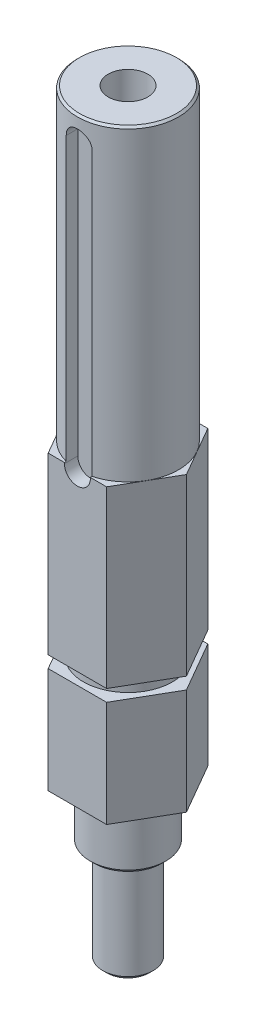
ISO-10303-21;
HEADER;
FILE_DESCRIPTION(('STEP AP214'),'2;1');
FILE_NAME('part.step','',(''),(''),'','','');
FILE_SCHEMA(('AUTOMOTIVE_DESIGN { 1 0 10303 214 1 1 1 1 }'));
ENDSEC;
DATA;
#1=APPLICATION_CONTEXT('core data for automotive mechanical design processes');
#2=APPLICATION_PROTOCOL_DEFINITION('international standard','automotive_design',2000,#1);
#3=PRODUCT_CONTEXT('',#1,'mechanical');
#4=PRODUCT('Part','Part','',(#3));
#5=PRODUCT_RELATED_PRODUCT_CATEGORY('part','',(#4));
#6=PRODUCT_DEFINITION_FORMATION('','',#4);
#7=PRODUCT_DEFINITION_CONTEXT('part definition',#1,'design');
#8=PRODUCT_DEFINITION('design','',#6,#7);
#9=PRODUCT_DEFINITION_SHAPE('','',#8);
#10=(LENGTH_UNIT() NAMED_UNIT(*) SI_UNIT(.MILLI.,.METRE.));
#11=(NAMED_UNIT(*) PLANE_ANGLE_UNIT() SI_UNIT($,.RADIAN.));
#12=(NAMED_UNIT(*) SI_UNIT($,.STERADIAN.) SOLID_ANGLE_UNIT());
#13=UNCERTAINTY_MEASURE_WITH_UNIT(LENGTH_MEASURE(1.E-05),#10,'distance_accuracy_value','');
#14=(GEOMETRIC_REPRESENTATION_CONTEXT(3) GLOBAL_UNCERTAINTY_ASSIGNED_CONTEXT((#13)) GLOBAL_UNIT_ASSIGNED_CONTEXT((#10,
#11,#12)) REPRESENTATION_CONTEXT('',''));
#15=CARTESIAN_POINT('',(0.,0.,0.));
#16=DIRECTION('',(0.,0.,1.));
#17=DIRECTION('',(1.,0.,0.));
#18=AXIS2_PLACEMENT_3D('',#15,#16,#17);
#19=CARTESIAN_POINT('',(-38.3071337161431,-56.515,-16.669011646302));
#20=DIRECTION('',(0.,1.,0.));
#21=DIRECTION('',(0.,0.,1.));
#22=AXIS2_PLACEMENT_3D('',#19,#20,#21);
#23=PLANE('',#22);
#24=CARTESIAN_POINT('',(-38.3071337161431,-56.515000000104,-16.669011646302));
#25=DIRECTION('',(0.,1.,0.));
#26=DIRECTION('',(0.,0.,1.));
#27=AXIS2_PLACEMENT_3D('',#24,#25,#26);
#28=CIRCLE('',#27,2.6542999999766);
#29=CARTESIAN_POINT('',(-38.3071337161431,-56.515000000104,-14.0147116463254));
#30=VERTEX_POINT('',#29);
#31=EDGE_CURVE('E19',#30,#30,#28,.T.);
#32=ORIENTED_EDGE('',*,*,#31,.F.);
#33=EDGE_LOOP('',(#32));
#34=FACE_BOUND('',#33,.T.);
#35=ADVANCED_FACE('F16',(#34),#23,.F.);
#36=CARTESIAN_POINT('',(-38.3071337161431,-56.007000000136,-16.669011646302));
#37=DIRECTION('',(0.,1.,0.));
#38=DIRECTION('',(0.,0.,1.));
#39=AXIS2_PLACEMENT_3D('',#36,#37,#38);
#40=CONICAL_SURFACE('',#39,3.16229999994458,0.785398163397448);
#41=CARTESIAN_POINT('',(-38.3071337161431,-56.007,-16.669011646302));
#42=DIRECTION('',(0.,-1.,0.));
#43=DIRECTION('',(0.,0.,-1.));
#44=AXIS2_PLACEMENT_3D('',#41,#42,#43);
#45=CIRCLE('',#44,3.1623);
#46=CARTESIAN_POINT('',(-38.3071337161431,-56.007,-19.831311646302));
#47=VERTEX_POINT('',#46);
#48=EDGE_CURVE('E145',#47,#47,#45,.F.);
#49=ORIENTED_EDGE('',*,*,#48,.F.);
#50=EDGE_LOOP('',(#49));
#51=FACE_BOUND('',#50,.T.);
#52=ORIENTED_EDGE('',*,*,#31,.T.);
#53=EDGE_LOOP('',(#52));
#54=FACE_BOUND('',#53,.T.);
#55=ADVANCED_FACE('F399',(#51,#54),#40,.T.);
#56=CARTESIAN_POINT('',(-38.3071337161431,-56.515,-16.669011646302));
#57=DIRECTION('',(0.,-1.,0.));
#58=DIRECTION('',(0.,0.,-1.));
#59=AXIS2_PLACEMENT_3D('',#56,#57,#58);
#60=CYLINDRICAL_SURFACE('',#59,3.1623);
#61=CARTESIAN_POINT('',(-38.3071337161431,-43.815,-16.669011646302));
#62=DIRECTION('',(0.,-1.,0.));
#63=DIRECTION('',(0.,0.,-1.));
#64=AXIS2_PLACEMENT_3D('',#61,#62,#63);
#65=CIRCLE('',#64,3.1623);
#66=CARTESIAN_POINT('',(-38.3071337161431,-43.815,-19.831311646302));
#67=VERTEX_POINT('',#66);
#68=EDGE_CURVE('E148',#67,#67,#65,.T.);
#69=ORIENTED_EDGE('',*,*,#68,.T.);
#70=EDGE_LOOP('',(#69));
#71=FACE_BOUND('',#70,.T.);
#72=ORIENTED_EDGE('',*,*,#48,.T.);
#73=EDGE_LOOP('',(#72));
#74=FACE_BOUND('',#73,.T.);
#75=ADVANCED_FACE('F384',(#71,#74),#60,.T.);
#76=CARTESIAN_POINT('',(-38.3071337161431,-43.815,-16.669011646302));
#77=DIRECTION('',(0.,1.,0.));
#78=DIRECTION('',(0.,0.,1.));
#79=AXIS2_PLACEMENT_3D('',#76,#77,#78);
#80=PLANE('',#79);
#81=CARTESIAN_POINT('',(-38.3071337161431,-43.8149999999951,-16.669011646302));
#82=DIRECTION('',(0.,1.,0.));
#83=DIRECTION('',(0.,0.,1.));
#84=AXIS2_PLACEMENT_3D('',#81,#82,#83);
#85=CIRCLE('',#84,4.24180000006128);
#86=CARTESIAN_POINT('',(-38.3071337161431,-43.8149999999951,-12.4272116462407));
#87=VERTEX_POINT('',#86);
#88=EDGE_CURVE('E142',#87,#87,#85,.T.);
#89=ORIENTED_EDGE('',*,*,#88,.F.);
#90=EDGE_LOOP('',(#89));
#91=FACE_BOUND('',#90,.T.);
#92=ORIENTED_EDGE('',*,*,#68,.F.);
#93=EDGE_LOOP('',(#92));
#94=FACE_BOUND('',#93,.T.);
#95=ADVANCED_FACE('F387',(#91,#94),#80,.F.);
#96=CARTESIAN_POINT('',(-38.3071337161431,-43.3070000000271,-16.669011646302));
#97=DIRECTION('',(0.,1.,0.));
#98=DIRECTION('',(0.,0.,1.));
#99=AXIS2_PLACEMENT_3D('',#96,#97,#98);
#100=CONICAL_SURFACE('',#99,4.74980000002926,0.785398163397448);
#101=CARTESIAN_POINT('',(-38.3071337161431,-43.307,-16.669011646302));
#102=DIRECTION('',(0.,-1.,0.));
#103=DIRECTION('',(0.,0.,-1.));
#104=AXIS2_PLACEMENT_3D('',#101,#102,#103);
#105=CIRCLE('',#104,4.7498);
#106=CARTESIAN_POINT('',(-38.3071337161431,-43.307,-21.418811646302));
#107=VERTEX_POINT('',#106);
#108=EDGE_CURVE('E139',#107,#107,#105,.F.);
#109=ORIENTED_EDGE('',*,*,#108,.F.);
#110=EDGE_LOOP('',(#109));
#111=FACE_BOUND('',#110,.T.);
#112=ORIENTED_EDGE('',*,*,#88,.T.);
#113=EDGE_LOOP('',(#112));
#114=FACE_BOUND('',#113,.T.);
#115=ADVANCED_FACE('F389',(#111,#114),#100,.T.);
#116=CARTESIAN_POINT('',(-38.3071337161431,-43.815,-16.669011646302));
#117=DIRECTION('',(0.,-1.,0.));
#118=DIRECTION('',(0.,0.,-1.));
#119=AXIS2_PLACEMENT_3D('',#116,#117,#118);
#120=CYLINDRICAL_SURFACE('',#119,4.7498);
#121=CARTESIAN_POINT('',(-38.3071337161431,-36.703,-16.669011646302));
#122=DIRECTION('',(0.,-1.,0.));
#123=DIRECTION('',(0.,0.,-1.));
#124=AXIS2_PLACEMENT_3D('',#121,#122,#123);
#125=CIRCLE('',#124,4.7498);
#126=CARTESIAN_POINT('',(-38.3071337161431,-36.703,-21.418811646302));
#127=VERTEX_POINT('',#126);
#128=EDGE_CURVE('E121',#127,#127,#125,.T.);
#129=ORIENTED_EDGE('',*,*,#128,.T.);
#130=EDGE_LOOP('',(#129));
#131=FACE_BOUND('',#130,.T.);
#132=ORIENTED_EDGE('',*,*,#108,.T.);
#133=EDGE_LOOP('',(#132));
#134=FACE_BOUND('',#133,.T.);
#135=ADVANCED_FACE('F396',(#131,#134),#120,.T.);
#136=CARTESIAN_POINT('',(-38.3071337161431,-36.703,-3.96901164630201));
#137=DIRECTION('',(0.,1.,0.));
#138=DIRECTION('',(0.,0.,1.));
#139=AXIS2_PLACEMENT_3D('',#136,#137,#138);
#140=PLANE('',#139);
#141=DIRECTION('',(-0.5,0.,0.866025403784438));
#142=VECTOR('',#141,1.);
#143=CARTESIAN_POINT('',(-41.9733079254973,-36.703,-23.019011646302));
#144=LINE('',#143,#142);
#145=CARTESIAN_POINT('',(-41.9733079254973,-36.703,-23.019011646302));
#146=VERTEX_POINT('',#145);
#147=CARTESIAN_POINT('',(-45.6394821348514,-36.703,-16.669011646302));
#148=VERTEX_POINT('',#147);
#149=EDGE_CURVE('E110',#146,#148,#144,.T.);
#150=ORIENTED_EDGE('',*,*,#149,.F.);
#151=DIRECTION('',(-1.,0.,0.));
#152=VECTOR('',#151,1.);
#153=CARTESIAN_POINT('',(-34.640959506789,-36.703,-23.019011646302));
#154=LINE('',#153,#152);
#155=CARTESIAN_POINT('',(-34.640959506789,-36.703,-23.019011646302));
#156=VERTEX_POINT('',#155);
#157=EDGE_CURVE('E115',#156,#146,#154,.T.);
#158=ORIENTED_EDGE('',*,*,#157,.F.);
#159=DIRECTION('',(-0.5,0.,-0.866025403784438));
#160=VECTOR('',#159,1.);
#161=CARTESIAN_POINT('',(-30.9747852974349,-36.703,-16.669011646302));
#162=LINE('',#161,#160);
#163=CARTESIAN_POINT('',(-30.9747852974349,-36.703,-16.669011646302));
#164=VERTEX_POINT('',#163);
#165=EDGE_CURVE('E130',#164,#156,#162,.T.);
#166=ORIENTED_EDGE('',*,*,#165,.F.);
#167=DIRECTION('',(0.500000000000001,0.,-0.866025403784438));
#168=VECTOR('',#167,1.);
#169=CARTESIAN_POINT('',(-34.640959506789,-36.703,-10.319011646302));
#170=LINE('',#169,#168);
#171=CARTESIAN_POINT('',(-34.640959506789,-36.703,-10.319011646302));
#172=VERTEX_POINT('',#171);
#173=EDGE_CURVE('E347',#172,#164,#170,.T.);
#174=ORIENTED_EDGE('',*,*,#173,.F.);
#175=DIRECTION('',(1.,0.,0.));
#176=VECTOR('',#175,1.);
#177=CARTESIAN_POINT('',(-41.9733079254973,-36.703,-10.319011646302));
#178=LINE('',#177,#176);
#179=CARTESIAN_POINT('',(-41.9733079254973,-36.703,-10.319011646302));
#180=VERTEX_POINT('',#179);
#181=EDGE_CURVE('E341',#180,#172,#178,.T.);
#182=ORIENTED_EDGE('',*,*,#181,.F.);
#183=DIRECTION('',(0.5,0.,0.866025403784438));
#184=VECTOR('',#183,1.);
#185=CARTESIAN_POINT('',(-45.6394821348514,-36.703,-16.669011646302));
#186=LINE('',#185,#184);
#187=EDGE_CURVE('E118',#148,#180,#186,.T.);
#188=ORIENTED_EDGE('',*,*,#187,.F.);
#189=EDGE_LOOP('',(#150,#158,#166,#174,#182,#188));
#190=FACE_BOUND('',#189,.T.);
#191=ORIENTED_EDGE('',*,*,#128,.F.);
#192=EDGE_LOOP('',(#191));
#193=FACE_BOUND('',#192,.T.);
#194=ADVANCED_FACE('F112',(#190,#193),#140,.F.);
#195=CARTESIAN_POINT('',(-41.9733079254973,-36.703,-23.019011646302));
#196=DIRECTION('',(-0.866025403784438,0.,-0.5));
#197=DIRECTION('',(-0.5,0.,0.866025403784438));
#198=AXIS2_PLACEMENT_3D('',#195,#196,#197);
#199=PLANE('',#198);
#200=ORIENTED_EDGE('',*,*,#149,.T.);
#201=DIRECTION('',(0.,1.,0.));
#202=VECTOR('',#201,1.);
#203=CARTESIAN_POINT('',(-45.6394821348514,-36.703,-16.669011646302));
#204=LINE('',#203,#202);
#205=CARTESIAN_POINT('',(-45.6394821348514,-23.4188,-16.669011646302));
#206=VERTEX_POINT('',#205);
#207=EDGE_CURVE('E336',#206,#148,#204,.F.);
#208=ORIENTED_EDGE('',*,*,#207,.F.);
#209=DIRECTION('',(0.499999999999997,0.,-0.86602540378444));
#210=VECTOR('',#209,1.);
#211=CARTESIAN_POINT('',(-45.6394821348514,-23.4188,-16.669011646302));
#212=LINE('',#211,#210);
#213=CARTESIAN_POINT('',(-41.9733079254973,-23.4188,-23.019011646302));
#214=VERTEX_POINT('',#213);
#215=EDGE_CURVE('E127',#206,#214,#212,.T.);
#216=ORIENTED_EDGE('',*,*,#215,.T.);
#217=DIRECTION('',(0.,1.,0.));
#218=VECTOR('',#217,1.);
#219=CARTESIAN_POINT('',(-41.9733079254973,-36.703,-23.019011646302));
#220=LINE('',#219,#218);
#221=EDGE_CURVE('E124',#146,#214,#220,.T.);
#222=ORIENTED_EDGE('',*,*,#221,.F.);
#223=EDGE_LOOP('',(#200,#208,#216,#222));
#224=FACE_BOUND('',#223,.T.);
#225=ADVANCED_FACE('F125',(#224),#199,.T.);
#226=CARTESIAN_POINT('',(-34.640959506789,-36.703,-23.019011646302));
#227=DIRECTION('',(0.,0.,-1.));
#228=DIRECTION('',(-1.,0.,0.));
#229=AXIS2_PLACEMENT_3D('',#226,#227,#228);
#230=PLANE('',#229);
#231=ORIENTED_EDGE('',*,*,#157,.T.);
#232=ORIENTED_EDGE('',*,*,#221,.T.);
#233=DIRECTION('',(1.,0.,0.));
#234=VECTOR('',#233,1.);
#235=CARTESIAN_POINT('',(-21.7881364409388,-23.4188,-23.019011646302));
#236=LINE('',#235,#234);
#237=CARTESIAN_POINT('',(-34.640959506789,-23.4188,-23.019011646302));
#238=VERTEX_POINT('',#237);
#239=EDGE_CURVE('E329',#214,#238,#236,.T.);
#240=ORIENTED_EDGE('',*,*,#239,.T.);
#241=DIRECTION('',(0.,1.,0.));
#242=VECTOR('',#241,1.);
#243=CARTESIAN_POINT('',(-34.640959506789,-36.703,-23.019011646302));
#244=LINE('',#243,#242);
#245=EDGE_CURVE('E134',#156,#238,#244,.T.);
#246=ORIENTED_EDGE('',*,*,#245,.F.);
#247=EDGE_LOOP('',(#231,#232,#240,#246));
#248=FACE_BOUND('',#247,.T.);
#249=ADVANCED_FACE('F132',(#248),#230,.T.);
#250=CARTESIAN_POINT('',(-30.9747852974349,-36.703,-16.669011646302));
#251=DIRECTION('',(0.866025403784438,0.,-0.5));
#252=DIRECTION('',(-0.5,0.,-0.866025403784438));
#253=AXIS2_PLACEMENT_3D('',#250,#251,#252);
#254=PLANE('',#253);
#255=ORIENTED_EDGE('',*,*,#165,.T.);
#256=ORIENTED_EDGE('',*,*,#245,.T.);
#257=DIRECTION('',(0.499999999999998,0.,0.86602540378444));
#258=VECTOR('',#257,1.);
#259=CARTESIAN_POINT('',(-34.640959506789,-23.4188,-23.019011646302));
#260=LINE('',#259,#258);
#261=CARTESIAN_POINT('',(-30.9747852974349,-23.4188,-16.669011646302));
#262=VERTEX_POINT('',#261);
#263=EDGE_CURVE('E327',#238,#262,#260,.T.);
#264=ORIENTED_EDGE('',*,*,#263,.T.);
#265=DIRECTION('',(0.,1.,0.));
#266=VECTOR('',#265,1.);
#267=CARTESIAN_POINT('',(-30.9747852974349,-36.703,-16.669011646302));
#268=LINE('',#267,#266);
#269=EDGE_CURVE('E344',#164,#262,#268,.T.);
#270=ORIENTED_EDGE('',*,*,#269,.F.);
#271=EDGE_LOOP('',(#255,#256,#264,#270));
#272=FACE_BOUND('',#271,.T.);
#273=ADVANCED_FACE('F352',(#272),#254,.T.);
#274=CARTESIAN_POINT('',(-34.640959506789,-36.703,-10.319011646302));
#275=DIRECTION('',(0.866025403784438,0.,0.500000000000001));
#276=DIRECTION('',(0.500000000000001,0.,-0.866025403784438));
#277=AXIS2_PLACEMENT_3D('',#274,#275,#276);
#278=PLANE('',#277);
#279=ORIENTED_EDGE('',*,*,#173,.T.);
#280=ORIENTED_EDGE('',*,*,#269,.T.);
#281=DIRECTION('',(-0.499999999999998,0.,0.86602540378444));
#282=VECTOR('',#281,1.);
#283=CARTESIAN_POINT('',(-30.9747852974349,-23.4188,-16.669011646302));
#284=LINE('',#283,#282);
#285=CARTESIAN_POINT('',(-34.640959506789,-23.4188,-10.319011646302));
#286=VERTEX_POINT('',#285);
#287=EDGE_CURVE('E325',#262,#286,#284,.T.);
#288=ORIENTED_EDGE('',*,*,#287,.T.);
#289=DIRECTION('',(0.,1.,0.));
#290=VECTOR('',#289,1.);
#291=CARTESIAN_POINT('',(-34.640959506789,-36.703,-10.319011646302));
#292=LINE('',#291,#290);
#293=EDGE_CURVE('E338',#172,#286,#292,.T.);
#294=ORIENTED_EDGE('',*,*,#293,.F.);
#295=EDGE_LOOP('',(#279,#280,#288,#294));
#296=FACE_BOUND('',#295,.T.);
#297=ADVANCED_FACE('F357',(#296),#278,.T.);
#298=CARTESIAN_POINT('',(-41.9733079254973,-36.703,-10.319011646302));
#299=DIRECTION('',(0.,0.,1.));
#300=DIRECTION('',(1.,0.,0.));
#301=AXIS2_PLACEMENT_3D('',#298,#299,#300);
#302=PLANE('',#301);
#303=ORIENTED_EDGE('',*,*,#181,.T.);
#304=ORIENTED_EDGE('',*,*,#293,.T.);
#305=DIRECTION('',(1.,0.,0.));
#306=VECTOR('',#305,1.);
#307=CARTESIAN_POINT('',(-21.7881364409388,-23.4188,-10.319011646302));
#308=LINE('',#307,#306);
#309=CARTESIAN_POINT('',(-41.9733079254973,-23.4188,-10.319011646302));
#310=VERTEX_POINT('',#309);
#311=EDGE_CURVE('E323',#286,#310,#308,.F.);
#312=ORIENTED_EDGE('',*,*,#311,.T.);
#313=DIRECTION('',(0.,1.,0.));
#314=VECTOR('',#313,1.);
#315=CARTESIAN_POINT('',(-41.9733079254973,-36.703,-10.319011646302));
#316=LINE('',#315,#314);
#317=EDGE_CURVE('E332',#180,#310,#316,.T.);
#318=ORIENTED_EDGE('',*,*,#317,.F.);
#319=EDGE_LOOP('',(#303,#304,#312,#318));
#320=FACE_BOUND('',#319,.T.);
#321=ADVANCED_FACE('F361',(#320),#302,.T.);
#322=CARTESIAN_POINT('',(-45.6394821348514,-36.703,-16.669011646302));
#323=DIRECTION('',(-0.866025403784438,0.,0.5));
#324=DIRECTION('',(0.5,0.,0.866025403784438));
#325=AXIS2_PLACEMENT_3D('',#322,#323,#324);
#326=PLANE('',#325);
#327=ORIENTED_EDGE('',*,*,#187,.T.);
#328=ORIENTED_EDGE('',*,*,#317,.T.);
#329=DIRECTION('',(-0.499999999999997,0.,-0.86602540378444));
#330=VECTOR('',#329,1.);
#331=CARTESIAN_POINT('',(-41.9733079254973,-23.4188,-10.319011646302));
#332=LINE('',#331,#330);
#333=EDGE_CURVE('E320',#310,#206,#332,.T.);
#334=ORIENTED_EDGE('',*,*,#333,.T.);
#335=ORIENTED_EDGE('',*,*,#207,.T.);
#336=EDGE_LOOP('',(#327,#328,#334,#335));
#337=FACE_BOUND('',#336,.T.);
#338=ADVANCED_FACE('F364',(#337),#326,.T.);
#339=CARTESIAN_POINT('',(-21.7881364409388,-23.4188,-16.669011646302));
#340=DIRECTION('',(0.,-1.,0.));
#341=DIRECTION('',(0.,0.,-1.));
#342=AXIS2_PLACEMENT_3D('',#339,#340,#341);
#343=PLANE('',#342);
#344=ORIENTED_EDGE('',*,*,#311,.F.);
#345=ORIENTED_EDGE('',*,*,#287,.F.);
#346=ORIENTED_EDGE('',*,*,#263,.F.);
#347=ORIENTED_EDGE('',*,*,#239,.F.);
#348=ORIENTED_EDGE('',*,*,#215,.F.);
#349=ORIENTED_EDGE('',*,*,#333,.F.);
#350=EDGE_LOOP('',(#344,#345,#346,#347,#348,#349));
#351=FACE_BOUND('',#350,.T.);
#352=CARTESIAN_POINT('',(-38.3071337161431,-23.4188,-16.669011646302));
#353=DIRECTION('',(0.,-1.,0.));
#354=DIRECTION('',(0.,0.,-1.));
#355=AXIS2_PLACEMENT_3D('',#352,#353,#354);
#356=CIRCLE('',#355,5.58800000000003);
#357=CARTESIAN_POINT('',(-38.3071337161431,-23.4188,-22.257011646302));
#358=VERTEX_POINT('',#357);
#359=EDGE_CURVE('E317',#358,#358,#356,.F.);
#360=ORIENTED_EDGE('',*,*,#359,.F.);
#361=EDGE_LOOP('',(#360));
#362=FACE_BOUND('',#361,.T.);
#363=ADVANCED_FACE('F366',(#351,#362),#343,.F.);
#364=CARTESIAN_POINT('',(-38.3071337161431,22.7329999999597,-16.669011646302));
#365=DIRECTION('',(0.,1.,0.));
#366=DIRECTION('',(0.,0.,1.));
#367=AXIS2_PLACEMENT_3D('',#364,#365,#366);
#368=CONICAL_SURFACE('',#367,2.48792999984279,1.02974425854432);
#369=CARTESIAN_POINT('',(-38.3071337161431,21.2381008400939,-16.6690116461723));
#370=VERTEX_POINT('',#369);
#371=VERTEX_LOOP('',#370);
#372=FACE_BOUND('',#371,.T.);
#373=CARTESIAN_POINT('',(-38.3071337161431,22.733,-16.669011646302));
#374=DIRECTION('',(0.,1.,0.));
#375=DIRECTION('',(0.,0.,1.));
#376=AXIS2_PLACEMENT_3D('',#373,#374,#375);
#377=CIRCLE('',#376,2.48793);
#378=CARTESIAN_POINT('',(-38.3071337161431,22.733,-14.181081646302));
#379=VERTEX_POINT('',#378);
#380=EDGE_CURVE('E314',#379,#379,#377,.T.);
#381=ORIENTED_EDGE('',*,*,#380,.T.);
#382=EDGE_LOOP('',(#381));
#383=FACE_BOUND('',#382,.T.);
#384=ADVANCED_FACE('F369',(#372,#383),#368,.F.);
#385=CARTESIAN_POINT('',(-38.3071337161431,-25.4,-16.669011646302));
#386=DIRECTION('',(0.,-1.,0.));
#387=DIRECTION('',(0.,0.,-1.));
#388=AXIS2_PLACEMENT_3D('',#385,#386,#387);
#389=CYLINDRICAL_SURFACE('',#388,5.58800000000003);
#390=ORIENTED_EDGE('',*,*,#359,.T.);
#391=EDGE_LOOP('',(#390));
#392=FACE_BOUND('',#391,.T.);
#393=CARTESIAN_POINT('',(-38.3071337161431,-21.9202,-16.669011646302));
#394=DIRECTION('',(0.,-1.,0.));
#395=DIRECTION('',(0.,0.,-1.));
#396=AXIS2_PLACEMENT_3D('',#393,#394,#395);
#397=CIRCLE('',#396,5.58800000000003);
#398=CARTESIAN_POINT('',(-38.3071337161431,-21.9202,-22.257011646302));
#399=VERTEX_POINT('',#398);
#400=EDGE_CURVE('E265',#399,#399,#397,.T.);
#401=ORIENTED_EDGE('',*,*,#400,.T.);
#402=EDGE_LOOP('',(#401));
#403=FACE_BOUND('',#402,.T.);
#404=ADVANCED_FACE('F491',(#392,#403),#389,.T.);
#405=CARTESIAN_POINT('',(-38.3071337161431,38.608,-16.669011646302));
#406=DIRECTION('',(0.,1.,0.));
#407=DIRECTION('',(0.,0.,1.));
#408=AXIS2_PLACEMENT_3D('',#405,#406,#407);
#409=CYLINDRICAL_SURFACE('',#408,2.48793);
#410=CARTESIAN_POINT('',(-38.3071337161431,38.608,-16.669011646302));
#411=DIRECTION('',(0.,1.,0.));
#412=DIRECTION('',(0.,0.,1.));
#413=AXIS2_PLACEMENT_3D('',#410,#411,#412);
#414=CIRCLE('',#413,2.48793);
#415=CARTESIAN_POINT('',(-38.3071337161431,38.608,-14.181081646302));
#416=VERTEX_POINT('',#415);
#417=EDGE_CURVE('E267',#416,#416,#414,.T.);
#418=ORIENTED_EDGE('',*,*,#417,.T.);
#419=EDGE_LOOP('',(#418));
#420=FACE_BOUND('',#419,.T.);
#421=ORIENTED_EDGE('',*,*,#380,.F.);
#422=EDGE_LOOP('',(#421));
#423=FACE_BOUND('',#422,.T.);
#424=ADVANCED_FACE('F498',(#420,#423),#409,.F.);
#425=CARTESIAN_POINT('',(-32.7191337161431,-21.9202,-16.669011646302));
#426=DIRECTION('',(0.,1.,0.));
#427=DIRECTION('',(0.,0.,1.));
#428=AXIS2_PLACEMENT_3D('',#425,#426,#427);
#429=PLANE('',#428);
#430=ORIENTED_EDGE('',*,*,#400,.F.);
#431=EDGE_LOOP('',(#430));
#432=FACE_BOUND('',#431,.T.);
#433=DIRECTION('',(0.500000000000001,0.,-0.866025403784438));
#434=VECTOR('',#433,1.);
#435=CARTESIAN_POINT('',(-34.640959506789,-21.9202,-10.319011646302));
#436=LINE('',#435,#434);
#437=CARTESIAN_POINT('',(-34.640959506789,-21.9202,-10.319011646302));
#438=VERTEX_POINT('',#437);
#439=CARTESIAN_POINT('',(-30.9747852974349,-21.9202,-16.669011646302));
#440=VERTEX_POINT('',#439);
#441=EDGE_CURVE('E232',#438,#440,#436,.T.);
#442=ORIENTED_EDGE('',*,*,#441,.F.);
#443=DIRECTION('',(1.,0.,0.));
#444=VECTOR('',#443,1.);
#445=CARTESIAN_POINT('',(-41.9733079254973,-21.9202,-10.319011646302));
#446=LINE('',#445,#444);
#447=CARTESIAN_POINT('',(-41.9733079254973,-21.9202,-10.319011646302));
#448=VERTEX_POINT('',#447);
#449=EDGE_CURVE('E233',#448,#438,#446,.T.);
#450=ORIENTED_EDGE('',*,*,#449,.F.);
#451=DIRECTION('',(0.5,0.,0.866025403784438));
#452=VECTOR('',#451,1.);
#453=CARTESIAN_POINT('',(-45.6394821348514,-21.9202,-16.669011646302));
#454=LINE('',#453,#452);
#455=CARTESIAN_POINT('',(-45.6394821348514,-21.9202,-16.669011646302));
#456=VERTEX_POINT('',#455);
#457=EDGE_CURVE('E256',#456,#448,#454,.T.);
#458=ORIENTED_EDGE('',*,*,#457,.F.);
#459=DIRECTION('',(-0.5,0.,0.866025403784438));
#460=VECTOR('',#459,1.);
#461=CARTESIAN_POINT('',(-41.9733079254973,-21.9202,-23.019011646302));
#462=LINE('',#461,#460);
#463=CARTESIAN_POINT('',(-41.9733079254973,-21.9202,-23.019011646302));
#464=VERTEX_POINT('',#463);
#465=EDGE_CURVE('E277',#464,#456,#462,.T.);
#466=ORIENTED_EDGE('',*,*,#465,.F.);
#467=DIRECTION('',(-1.,0.,0.));
#468=VECTOR('',#467,1.);
#469=CARTESIAN_POINT('',(-34.640959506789,-21.9202,-23.019011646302));
#470=LINE('',#469,#468);
#471=CARTESIAN_POINT('',(-34.640959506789,-21.9202,-23.019011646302));
#472=VERTEX_POINT('',#471);
#473=EDGE_CURVE('E288',#472,#464,#470,.T.);
#474=ORIENTED_EDGE('',*,*,#473,.F.);
#475=DIRECTION('',(-0.5,0.,-0.866025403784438));
#476=VECTOR('',#475,1.);
#477=CARTESIAN_POINT('',(-30.9747852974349,-21.9202,-16.669011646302));
#478=LINE('',#477,#476);
#479=EDGE_CURVE('E249',#440,#472,#478,.T.);
#480=ORIENTED_EDGE('',*,*,#479,.F.);
#481=EDGE_LOOP('',(#442,#450,#458,#466,#474,#480));
#482=FACE_BOUND('',#481,.T.);
#483=ADVANCED_FACE('F505',(#432,#482),#429,.F.);
#484=CARTESIAN_POINT('',(-38.3071337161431,-0.126999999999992,-11.995411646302));
#485=DIRECTION('',(0.,0.,-1.));
#486=DIRECTION('',(-1.,0.,0.));
#487=AXIS2_PLACEMENT_3D('',#484,#485,#486);
#488=CYLINDRICAL_SURFACE('',#487,1.6256);
#489=DIRECTION('',(0.,0.,-1.));
#490=VECTOR('',#489,1.);
#491=CARTESIAN_POINT('',(-36.6815337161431,-0.126999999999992,-11.995411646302));
#492=LINE('',#491,#490);
#493=CARTESIAN_POINT('',(-36.6815337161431,-0.126999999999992,-11.995411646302));
#494=VERTEX_POINT('',#493);
#495=CARTESIAN_POINT('',(-36.6815337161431,-0.126999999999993,-10.319011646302));
#496=VERTEX_POINT('',#495);
#497=EDGE_CURVE('E64',#494,#496,#492,.F.);
#498=ORIENTED_EDGE('',*,*,#497,.F.);
#499=CARTESIAN_POINT('',(-38.3071337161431,-0.126999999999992,-11.995411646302));
#500=DIRECTION('',(0.,0.,-1.));
#501=DIRECTION('',(-1.,0.,0.));
#502=AXIS2_PLACEMENT_3D('',#499,#500,#501);
#503=CIRCLE('',#502,1.6256);
#504=CARTESIAN_POINT('',(-39.9327337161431,-0.126999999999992,-11.995411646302));
#505=VERTEX_POINT('',#504);
#506=EDGE_CURVE('E285',#494,#505,#503,.T.);
#507=ORIENTED_EDGE('',*,*,#506,.T.);
#508=DIRECTION('',(0.,0.,-1.));
#509=VECTOR('',#508,1.);
#510=CARTESIAN_POINT('',(-39.9327337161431,-0.126999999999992,-11.995411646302));
#511=LINE('',#510,#509);
#512=CARTESIAN_POINT('',(-39.9327337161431,-0.126999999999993,-10.319011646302));
#513=VERTEX_POINT('',#512);
#514=EDGE_CURVE('E263',#513,#505,#511,.T.);
#515=ORIENTED_EDGE('',*,*,#514,.F.);
#516=CARTESIAN_POINT('',(-38.3071337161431,-0.126999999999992,-10.319011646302));
#517=DIRECTION('',(0.,0.,-1.));
#518=DIRECTION('',(-1.,0.,0.));
#519=AXIS2_PLACEMENT_3D('',#516,#517,#518);
#520=CIRCLE('',#519,1.6256);
#521=EDGE_CURVE('E239',#496,#513,#520,.T.);
#522=ORIENTED_EDGE('',*,*,#521,.F.);
#523=EDGE_LOOP('',(#498,#507,#515,#522));
#524=FACE_BOUND('',#523,.T.);
#525=ADVANCED_FACE('F513',(#524),#488,.F.);
#526=CARTESIAN_POINT('',(-38.3071337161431,38.608,-16.669011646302));
#527=DIRECTION('',(0.,-1.,0.));
#528=DIRECTION('',(0.,0.,-1.));
#529=AXIS2_PLACEMENT_3D('',#526,#527,#528);
#530=PLANE('',#529);
#531=ORIENTED_EDGE('',*,*,#417,.F.);
#532=EDGE_LOOP('',(#531));
#533=FACE_BOUND('',#532,.T.);
#534=CARTESIAN_POINT('',(-38.3071337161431,38.6080000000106,-16.669011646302));
#535=DIRECTION('',(0.,-1.,0.));
#536=DIRECTION('',(0.,0.,-1.));
#537=AXIS2_PLACEMENT_3D('',#534,#535,#536);
#538=CIRCLE('',#537,6.08329999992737);
#539=CARTESIAN_POINT('',(-38.3071337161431,38.6080000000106,-22.7523116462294));
#540=VERTEX_POINT('',#539);
#541=EDGE_CURVE('E228',#540,#540,#538,.T.);
#542=ORIENTED_EDGE('',*,*,#541,.F.);
#543=EDGE_LOOP('',(#542));
#544=FACE_BOUND('',#543,.T.);
#545=ADVANCED_FACE('F521',(#533,#544),#530,.F.);
#546=CARTESIAN_POINT('',(-41.9733079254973,-36.703,-10.319011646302));
#547=DIRECTION('',(0.,0.,1.));
#548=DIRECTION('',(1.,0.,0.));
#549=AXIS2_PLACEMENT_3D('',#546,#547,#548);
#550=PLANE('',#549);
#551=DIRECTION('',(1.,0.,0.));
#552=VECTOR('',#551,1.);
#553=CARTESIAN_POINT('',(-38.3071337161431,0.,-10.319011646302));
#554=LINE('',#553,#552);
#555=CARTESIAN_POINT('',(-36.6815337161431,0.,-10.319011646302));
#556=VERTEX_POINT('',#555);
#557=CARTESIAN_POINT('',(-34.640959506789,0.,-10.319011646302));
#558=VERTEX_POINT('',#557);
#559=EDGE_CURVE('E219',#556,#558,#554,.T.);
#560=ORIENTED_EDGE('',*,*,#559,.F.);
#561=DIRECTION('',(0.,1.,0.));
#562=VECTOR('',#561,1.);
#563=CARTESIAN_POINT('',(-36.6815337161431,-36.703,-10.319011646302));
#564=LINE('',#563,#562);
#565=EDGE_CURVE('E180',#556,#496,#564,.F.);
#566=ORIENTED_EDGE('',*,*,#565,.T.);
#567=ORIENTED_EDGE('',*,*,#521,.T.);
#568=DIRECTION('',(0.,1.,0.));
#569=VECTOR('',#568,1.);
#570=CARTESIAN_POINT('',(-39.9327337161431,-36.703,-10.319011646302));
#571=LINE('',#570,#569);
#572=CARTESIAN_POINT('',(-39.9327337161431,0.,-10.319011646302));
#573=VERTEX_POINT('',#572);
#574=EDGE_CURVE('E236',#513,#573,#571,.T.);
#575=ORIENTED_EDGE('',*,*,#574,.T.);
#576=DIRECTION('',(1.,0.,0.));
#577=VECTOR('',#576,1.);
#578=CARTESIAN_POINT('',(-38.3071337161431,0.,-10.319011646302));
#579=LINE('',#578,#577);
#580=CARTESIAN_POINT('',(-41.9733079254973,0.,-10.319011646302));
#581=VERTEX_POINT('',#580);
#582=EDGE_CURVE('E221',#581,#573,#579,.T.);
#583=ORIENTED_EDGE('',*,*,#582,.F.);
#584=DIRECTION('',(0.,1.,0.));
#585=VECTOR('',#584,1.);
#586=CARTESIAN_POINT('',(-41.9733079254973,-36.703,-10.319011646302));
#587=LINE('',#586,#585);
#588=EDGE_CURVE('E252',#448,#581,#587,.T.);
#589=ORIENTED_EDGE('',*,*,#588,.F.);
#590=ORIENTED_EDGE('',*,*,#449,.T.);
#591=DIRECTION('',(0.,1.,0.));
#592=VECTOR('',#591,1.);
#593=CARTESIAN_POINT('',(-34.640959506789,-36.703,-10.319011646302));
#594=LINE('',#593,#592);
#595=EDGE_CURVE('E246',#558,#438,#594,.F.);
#596=ORIENTED_EDGE('',*,*,#595,.F.);
#597=EDGE_LOOP('',(#560,#566,#567,#575,#583,#589,#590,#596));
#598=FACE_BOUND('',#597,.T.);
#599=ADVANCED_FACE('F529',(#598),#550,.T.);
#600=CARTESIAN_POINT('',(-34.640959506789,-36.703,-10.319011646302));
#601=DIRECTION('',(0.866025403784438,0.,0.500000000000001));
#602=DIRECTION('',(0.500000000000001,0.,-0.866025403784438));
#603=AXIS2_PLACEMENT_3D('',#600,#601,#602);
#604=PLANE('',#603);
#605=DIRECTION('',(0.499999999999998,0.,-0.86602540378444));
#606=VECTOR('',#605,1.);
#607=CARTESIAN_POINT('',(-34.640959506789,0.,-10.319011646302));
#608=LINE('',#607,#606);
#609=CARTESIAN_POINT('',(-30.9747852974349,0.,-16.669011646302));
#610=VERTEX_POINT('',#609);
#611=EDGE_CURVE('E218',#558,#610,#608,.T.);
#612=ORIENTED_EDGE('',*,*,#611,.F.);
#613=ORIENTED_EDGE('',*,*,#595,.T.);
#614=ORIENTED_EDGE('',*,*,#441,.T.);
#615=DIRECTION('',(0.,1.,0.));
#616=VECTOR('',#615,1.);
#617=CARTESIAN_POINT('',(-30.9747852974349,-36.703,-16.669011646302));
#618=LINE('',#617,#616);
#619=EDGE_CURVE('E291',#610,#440,#618,.F.);
#620=ORIENTED_EDGE('',*,*,#619,.F.);
#621=EDGE_LOOP('',(#612,#613,#614,#620));
#622=FACE_BOUND('',#621,.T.);
#623=ADVANCED_FACE('F537',(#622),#604,.T.);
#624=CARTESIAN_POINT('',(-30.9747852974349,-36.703,-16.669011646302));
#625=DIRECTION('',(0.866025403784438,0.,-0.5));
#626=DIRECTION('',(-0.5,0.,-0.866025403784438));
#627=AXIS2_PLACEMENT_3D('',#624,#625,#626);
#628=PLANE('',#627);
#629=DIRECTION('',(-0.499999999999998,0.,-0.86602540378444));
#630=VECTOR('',#629,1.);
#631=CARTESIAN_POINT('',(-30.9747852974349,0.,-16.669011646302));
#632=LINE('',#631,#630);
#633=CARTESIAN_POINT('',(-34.640959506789,0.,-23.019011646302));
#634=VERTEX_POINT('',#633);
#635=EDGE_CURVE('E215',#610,#634,#632,.T.);
#636=ORIENTED_EDGE('',*,*,#635,.F.);
#637=ORIENTED_EDGE('',*,*,#619,.T.);
#638=ORIENTED_EDGE('',*,*,#479,.T.);
#639=DIRECTION('',(0.,1.,0.));
#640=VECTOR('',#639,1.);
#641=CARTESIAN_POINT('',(-34.640959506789,-36.703,-23.019011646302));
#642=LINE('',#641,#640);
#643=EDGE_CURVE('E280',#634,#472,#642,.F.);
#644=ORIENTED_EDGE('',*,*,#643,.F.);
#645=EDGE_LOOP('',(#636,#637,#638,#644));
#646=FACE_BOUND('',#645,.T.);
#647=ADVANCED_FACE('F545',(#646),#628,.T.);
#648=CARTESIAN_POINT('',(-34.640959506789,-36.703,-23.019011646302));
#649=DIRECTION('',(0.,0.,-1.));
#650=DIRECTION('',(-1.,0.,0.));
#651=AXIS2_PLACEMENT_3D('',#648,#649,#650);
#652=PLANE('',#651);
#653=DIRECTION('',(1.,0.,0.));
#654=VECTOR('',#653,1.);
#655=CARTESIAN_POINT('',(-38.3071337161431,0.,-23.019011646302));
#656=LINE('',#655,#654);
#657=CARTESIAN_POINT('',(-41.9733079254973,0.,-23.019011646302));
#658=VERTEX_POINT('',#657);
#659=EDGE_CURVE('E212',#634,#658,#656,.F.);
#660=ORIENTED_EDGE('',*,*,#659,.F.);
#661=ORIENTED_EDGE('',*,*,#643,.T.);
#662=ORIENTED_EDGE('',*,*,#473,.T.);
#663=DIRECTION('',(0.,1.,0.));
#664=VECTOR('',#663,1.);
#665=CARTESIAN_POINT('',(-41.9733079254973,-36.703,-23.019011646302));
#666=LINE('',#665,#664);
#667=EDGE_CURVE('E274',#658,#464,#666,.F.);
#668=ORIENTED_EDGE('',*,*,#667,.F.);
#669=EDGE_LOOP('',(#660,#661,#662,#668));
#670=FACE_BOUND('',#669,.T.);
#671=ADVANCED_FACE('F553',(#670),#652,.T.);
#672=CARTESIAN_POINT('',(-41.9733079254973,-36.703,-23.019011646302));
#673=DIRECTION('',(-0.866025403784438,0.,-0.5));
#674=DIRECTION('',(-0.5,0.,0.866025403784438));
#675=AXIS2_PLACEMENT_3D('',#672,#673,#674);
#676=PLANE('',#675);
#677=DIRECTION('',(-0.499999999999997,0.,0.86602540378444));
#678=VECTOR('',#677,1.);
#679=CARTESIAN_POINT('',(-41.9733079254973,0.,-23.019011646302));
#680=LINE('',#679,#678);
#681=CARTESIAN_POINT('',(-45.6394821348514,0.,-16.669011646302));
#682=VERTEX_POINT('',#681);
#683=EDGE_CURVE('E209',#658,#682,#680,.T.);
#684=ORIENTED_EDGE('',*,*,#683,.F.);
#685=ORIENTED_EDGE('',*,*,#667,.T.);
#686=ORIENTED_EDGE('',*,*,#465,.T.);
#687=DIRECTION('',(0.,1.,0.));
#688=VECTOR('',#687,1.);
#689=CARTESIAN_POINT('',(-45.6394821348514,-36.703,-16.669011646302));
#690=LINE('',#689,#688);
#691=EDGE_CURVE('E255',#682,#456,#690,.F.);
#692=ORIENTED_EDGE('',*,*,#691,.F.);
#693=EDGE_LOOP('',(#684,#685,#686,#692));
#694=FACE_BOUND('',#693,.T.);
#695=ADVANCED_FACE('F561',(#694),#676,.T.);
#696=CARTESIAN_POINT('',(-45.6394821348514,-36.703,-16.669011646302));
#697=DIRECTION('',(-0.866025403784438,0.,0.5));
#698=DIRECTION('',(0.5,0.,0.866025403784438));
#699=AXIS2_PLACEMENT_3D('',#696,#697,#698);
#700=PLANE('',#699);
#701=DIRECTION('',(0.499999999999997,0.,0.86602540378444));
#702=VECTOR('',#701,1.);
#703=CARTESIAN_POINT('',(-45.6394821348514,0.,-16.669011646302));
#704=LINE('',#703,#702);
#705=EDGE_CURVE('E206',#682,#581,#704,.T.);
#706=ORIENTED_EDGE('',*,*,#705,.F.);
#707=ORIENTED_EDGE('',*,*,#691,.T.);
#708=ORIENTED_EDGE('',*,*,#457,.T.);
#709=ORIENTED_EDGE('',*,*,#588,.T.);
#710=EDGE_LOOP('',(#706,#707,#708,#709));
#711=FACE_BOUND('',#710,.T.);
#712=ADVANCED_FACE('F569',(#711),#700,.T.);
#713=CARTESIAN_POINT('',(-38.3071337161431,-0.126999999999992,-11.995411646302));
#714=DIRECTION('',(0.,0.,-1.));
#715=DIRECTION('',(-1.,0.,0.));
#716=AXIS2_PLACEMENT_3D('',#713,#714,#715);
#717=PLANE('',#716);
#718=DIRECTION('',(0.,-1.,0.));
#719=VECTOR('',#718,1.);
#720=CARTESIAN_POINT('',(-36.6815337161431,-0.126999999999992,-11.995411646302));
#721=LINE('',#720,#719);
#722=CARTESIAN_POINT('',(-36.6815337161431,35.433,-11.995411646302));
#723=VERTEX_POINT('',#722);
#724=EDGE_CURVE('E185',#723,#494,#721,.T.);
#725=ORIENTED_EDGE('',*,*,#724,.F.);
#726=CARTESIAN_POINT('',(-38.3071337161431,35.433,-11.995411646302));
#727=DIRECTION('',(0.,0.,-1.));
#728=DIRECTION('',(-1.,0.,0.));
#729=AXIS2_PLACEMENT_3D('',#726,#727,#728);
#730=CIRCLE('',#729,1.6256);
#731=CARTESIAN_POINT('',(-39.9327337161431,35.433,-11.995411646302));
#732=VERTEX_POINT('',#731);
#733=EDGE_CURVE('E193',#723,#732,#730,.F.);
#734=ORIENTED_EDGE('',*,*,#733,.T.);
#735=DIRECTION('',(0.,1.,0.));
#736=VECTOR('',#735,1.);
#737=CARTESIAN_POINT('',(-39.9327337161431,-0.126999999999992,-11.995411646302));
#738=LINE('',#737,#736);
#739=EDGE_CURVE('E199',#505,#732,#738,.T.);
#740=ORIENTED_EDGE('',*,*,#739,.F.);
#741=ORIENTED_EDGE('',*,*,#506,.F.);
#742=EDGE_LOOP('',(#725,#734,#740,#741));
#743=FACE_BOUND('',#742,.T.);
#744=ADVANCED_FACE('F577',(#743),#717,.F.);
#745=CARTESIAN_POINT('',(-38.3071337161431,38.3540000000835,-16.669011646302));
#746=DIRECTION('',(0.,-1.,0.));
#747=DIRECTION('',(0.,0.,-1.));
#748=AXIS2_PLACEMENT_3D('',#745,#746,#747);
#749=CONICAL_SURFACE('',#748,6.33729999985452,0.785398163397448);
#750=CARTESIAN_POINT('',(-38.3071337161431,38.354,-16.669011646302));
#751=DIRECTION('',(0.,1.,0.));
#752=DIRECTION('',(0.,0.,1.));
#753=AXIS2_PLACEMENT_3D('',#750,#751,#752);
#754=CIRCLE('',#753,6.3373);
#755=CARTESIAN_POINT('',(-38.3071337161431,38.354,-10.331711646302));
#756=VERTEX_POINT('',#755);
#757=EDGE_CURVE('E184',#756,#756,#754,.F.);
#758=ORIENTED_EDGE('',*,*,#757,.F.);
#759=EDGE_LOOP('',(#758));
#760=FACE_BOUND('',#759,.T.);
#761=ORIENTED_EDGE('',*,*,#541,.T.);
#762=EDGE_LOOP('',(#761));
#763=FACE_BOUND('',#762,.T.);
#764=ADVANCED_FACE('F585',(#760,#763),#749,.T.);
#765=CARTESIAN_POINT('',(-38.3071337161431,0.,-3.96901164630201));
#766=DIRECTION('',(0.,1.,0.));
#767=DIRECTION('',(0.,0.,1.));
#768=AXIS2_PLACEMENT_3D('',#765,#766,#767);
#769=PLANE('',#768);
#770=ORIENTED_EDGE('',*,*,#683,.T.);
#771=ORIENTED_EDGE('',*,*,#705,.T.);
#772=ORIENTED_EDGE('',*,*,#582,.T.);
#773=DIRECTION('',(0.,0.,1.));
#774=VECTOR('',#773,1.);
#775=CARTESIAN_POINT('',(-39.9327337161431,0.,-11.995411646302));
#776=LINE('',#775,#774);
#777=CARTESIAN_POINT('',(-39.9327337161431,0.,-10.5437528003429));
#778=VERTEX_POINT('',#777);
#779=EDGE_CURVE('E203',#778,#573,#776,.T.);
#780=ORIENTED_EDGE('',*,*,#779,.F.);
#781=CARTESIAN_POINT('',(-38.3071337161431,0.,-16.669011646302));
#782=DIRECTION('',(0.,1.,0.));
#783=DIRECTION('',(0.,0.,1.));
#784=AXIS2_PLACEMENT_3D('',#781,#782,#783);
#785=CIRCLE('',#784,6.3373);
#786=CARTESIAN_POINT('',(-36.6815337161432,0.,-10.5437528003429));
#787=VERTEX_POINT('',#786);
#788=EDGE_CURVE('E159',#787,#778,#785,.T.);
#789=ORIENTED_EDGE('',*,*,#788,.F.);
#790=DIRECTION('',(0.,0.,1.));
#791=VECTOR('',#790,1.);
#792=CARTESIAN_POINT('',(-36.6815337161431,0.,-11.995411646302));
#793=LINE('',#792,#791);
#794=EDGE_CURVE('E178',#556,#787,#793,.F.);
#795=ORIENTED_EDGE('',*,*,#794,.F.);
#796=ORIENTED_EDGE('',*,*,#559,.T.);
#797=ORIENTED_EDGE('',*,*,#611,.T.);
#798=ORIENTED_EDGE('',*,*,#635,.T.);
#799=ORIENTED_EDGE('',*,*,#659,.T.);
#800=EDGE_LOOP('',(#770,#771,#772,#780,#789,#795,#796,#797,#798,#799));
#801=FACE_BOUND('',#800,.T.);
#802=ADVANCED_FACE('F593',(#801),#769,.T.);
#803=CARTESIAN_POINT('',(-39.9327337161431,-0.126999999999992,-11.995411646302));
#804=DIRECTION('',(1.,0.,0.));
#805=DIRECTION('',(0.,1.,0.));
#806=AXIS2_PLACEMENT_3D('',#803,#804,#805);
#807=PLANE('',#806);
#808=DIRECTION('',(0.,0.,-1.));
#809=VECTOR('',#808,1.);
#810=CARTESIAN_POINT('',(-39.9327337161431,35.433,-11.995411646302));
#811=LINE('',#810,#809);
#812=CARTESIAN_POINT('',(-39.9327337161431,35.433,-10.5437528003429));
#813=VERTEX_POINT('',#812);
#814=EDGE_CURVE('E192',#732,#813,#811,.F.);
#815=ORIENTED_EDGE('',*,*,#814,.T.);
#816=DIRECTION('',(0.,1.,0.));
#817=VECTOR('',#816,1.);
#818=CARTESIAN_POINT('',(-39.9327337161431,38.608,-10.5437528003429));
#819=LINE('',#818,#817);
#820=EDGE_CURVE('E158',#778,#813,#819,.T.);
#821=ORIENTED_EDGE('',*,*,#820,.F.);
#822=ORIENTED_EDGE('',*,*,#779,.T.);
#823=ORIENTED_EDGE('',*,*,#574,.F.);
#824=ORIENTED_EDGE('',*,*,#514,.T.);
#825=ORIENTED_EDGE('',*,*,#739,.T.);
#826=EDGE_LOOP('',(#815,#821,#822,#823,#824,#825));
#827=FACE_BOUND('',#826,.T.);
#828=ADVANCED_FACE('F175',(#827),#807,.T.);
#829=CARTESIAN_POINT('',(-38.3071337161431,35.433,-11.995411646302));
#830=DIRECTION('',(0.,0.,-1.));
#831=DIRECTION('',(-1.,0.,0.));
#832=AXIS2_PLACEMENT_3D('',#829,#830,#831);
#833=CYLINDRICAL_SURFACE('',#832,1.6256);
#834=ORIENTED_EDGE('',*,*,#733,.F.);
#835=DIRECTION('',(0.,0.,1.));
#836=VECTOR('',#835,1.);
#837=CARTESIAN_POINT('',(-36.6815337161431,35.433,-11.995411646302));
#838=LINE('',#837,#836);
#839=CARTESIAN_POINT('',(-36.6815337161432,35.433,-10.5437528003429));
#840=VERTEX_POINT('',#839);
#841=EDGE_CURVE('E34',#840,#723,#838,.F.);
#842=ORIENTED_EDGE('',*,*,#841,.F.);
#843=CARTESIAN_POINT('',(-39.9327337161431,35.433,-10.5437528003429));
#844=CARTESIAN_POINT('',(-39.9327343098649,35.4779281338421,-10.543755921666));
#845=CARTESIAN_POINT('',(-39.9308699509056,35.5228339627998,-10.5432578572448));
#846=CARTESIAN_POINT('',(-39.9234381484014,35.6123089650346,-10.5412915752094));
#847=CARTESIAN_POINT('',(-39.9178713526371,35.6568781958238,-10.5398235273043));
#848=CARTESIAN_POINT('',(-39.8956998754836,35.7894076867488,-10.5340237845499));
#849=CARTESIAN_POINT('',(-39.8736237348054,35.876455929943,-10.5282961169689));
#850=CARTESIAN_POINT('',(-39.8156007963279,36.0454513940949,-10.5137878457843));
#851=CARTESIAN_POINT('',(-39.7796557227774,36.1273992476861,-10.5050076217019));
#852=CARTESIAN_POINT('',(-39.6949604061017,36.2841449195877,-10.4853887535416));
#853=CARTESIAN_POINT('',(-39.6462064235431,36.3589406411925,-10.4745495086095));
#854=CARTESIAN_POINT('',(-39.5360842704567,36.5009403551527,-10.4517558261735));
#855=CARTESIAN_POINT('',(-39.4744754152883,36.5679546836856,-10.4397829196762));
#856=CARTESIAN_POINT('',(-39.3409048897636,36.6908268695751,-10.416229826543));
#857=CARTESIAN_POINT('',(-39.2689415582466,36.7466829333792,-10.4046497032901));
#858=CARTESIAN_POINT('',(-39.1153942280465,36.8464329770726,-10.3829813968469));
#859=CARTESIAN_POINT('',(-39.0336841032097,36.8901385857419,-10.3729177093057));
#860=CARTESIAN_POINT('',(-38.8637790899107,36.9631193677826,-10.3556292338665));
#861=CARTESIAN_POINT('',(-38.7755855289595,36.9923974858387,-10.3484038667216));
#862=CARTESIAN_POINT('',(-38.5972039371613,37.0350815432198,-10.3377368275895));
#863=CARTESIAN_POINT('',(-38.5070981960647,37.0488117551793,-10.3342179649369));
#864=CARTESIAN_POINT('',(-38.3257961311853,37.061029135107,-10.3310910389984));
#865=CARTESIAN_POINT('',(-38.2345999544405,37.0595183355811,-10.331482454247));
#866=CARTESIAN_POINT('',(-38.0559619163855,37.041527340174,-10.3360750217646));
#867=CARTESIAN_POINT('',(-37.9684821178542,37.0253976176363,-10.3401869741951));
#868=CARTESIAN_POINT('',(-37.7975157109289,36.9791912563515,-10.3516541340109));
#869=CARTESIAN_POINT('',(-37.7140292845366,36.9491139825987,-10.3590094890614));
#870=CARTESIAN_POINT('',(-37.5525052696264,36.8755881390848,-10.376271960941));
#871=CARTESIAN_POINT('',(-37.4745263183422,36.8320164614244,-10.3862024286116));
#872=CARTESIAN_POINT('',(-37.3268671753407,36.7328332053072,-10.4075403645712));
#873=CARTESIAN_POINT('',(-37.2571883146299,36.6772196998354,-10.4189480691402));
#874=CARTESIAN_POINT('',(-37.1260216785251,36.5536672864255,-10.4423820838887));
#875=CARTESIAN_POINT('',(-37.0648222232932,36.4854235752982,-10.4544167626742));
#876=CARTESIAN_POINT('',(-36.9546556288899,36.3394966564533,-10.4774567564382));
#877=CARTESIAN_POINT('',(-36.9056918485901,36.2618108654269,-10.4884617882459));
#878=CARTESIAN_POINT('',(-36.8211846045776,36.0986037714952,-10.5082301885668));
#879=CARTESIAN_POINT('',(-36.7857215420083,36.0130391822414,-10.5169800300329));
#880=CARTESIAN_POINT('',(-36.7298203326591,35.836933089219,-10.5310723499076));
#881=CARTESIAN_POINT('',(-36.7093596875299,35.7463992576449,-10.5364199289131));
#882=CARTESIAN_POINT('',(-36.6916731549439,35.6180611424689,-10.5410693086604));
#883=CARTESIAN_POINT('',(-36.687870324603,35.5811281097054,-10.5420739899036));
#884=CARTESIAN_POINT('',(-36.6828033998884,35.507135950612,-10.543415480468));
#885=CARTESIAN_POINT('',(-36.6815352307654,35.4700771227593,-10.5437533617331));
#886=CARTESIAN_POINT('',(-36.6815337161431,35.433,-10.5437528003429));
#887=B_SPLINE_CURVE_WITH_KNOTS('',3,(#843,#844,#845,#846,#847,#848,#849,#850,#851,#852,#853,
#854,#855,#856,#857,#858,#859,#860,#861,#862,#863,#864,#865,#866,#867,#868,#869,#870,#871,#872,
#873,#874,#875,#876,#877,#878,#879,#880,#881,#882,#883,#884,#885,#886),.UNSPECIFIED.,.F.,.F.,(4,
2,2,2,2,2,2,2,2,2,2,2,2,2,2,2,2,2,2,2,2,4),(0.,0.134699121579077,0.26937468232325,
0.537937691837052,0.806467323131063,1.07507543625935,1.34925544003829,1.62347947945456,
1.90174385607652,2.17995141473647,2.45224307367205,2.7244984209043,2.99039453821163,
3.2563027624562,3.52471208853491,3.79316439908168,4.06922955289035,4.34537040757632,
4.62313096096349,4.90047411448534,5.0118250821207,5.12299689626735),.UNSPECIFIED.);
#888=EDGE_CURVE('E25',#813,#840,#887,.T.);
#889=ORIENTED_EDGE('',*,*,#888,.F.);
#890=ORIENTED_EDGE('',*,*,#814,.F.);
#891=EDGE_LOOP('',(#834,#842,#889,#890));
#892=FACE_BOUND('',#891,.T.);
#893=ADVANCED_FACE('F161',(#892),#833,.F.);
#894=CARTESIAN_POINT('',(-36.6815337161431,-0.126999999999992,-11.995411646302));
#895=DIRECTION('',(-1.,0.,0.));
#896=DIRECTION('',(0.,-1.,0.));
#897=AXIS2_PLACEMENT_3D('',#894,#895,#896);
#898=PLANE('',#897);
#899=ORIENTED_EDGE('',*,*,#794,.T.);
#900=DIRECTION('',(0.,1.,0.));
#901=VECTOR('',#900,1.);
#902=CARTESIAN_POINT('',(-36.6815337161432,38.608,-10.5437528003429));
#903=LINE('',#902,#901);
#904=EDGE_CURVE('E10',#840,#787,#903,.F.);
#905=ORIENTED_EDGE('',*,*,#904,.F.);
#906=ORIENTED_EDGE('',*,*,#841,.T.);
#907=ORIENTED_EDGE('',*,*,#724,.T.);
#908=ORIENTED_EDGE('',*,*,#497,.T.);
#909=ORIENTED_EDGE('',*,*,#565,.F.);
#910=EDGE_LOOP('',(#899,#905,#906,#907,#908,#909));
#911=FACE_BOUND('',#910,.T.);
#912=ADVANCED_FACE('F168',(#911),#898,.T.);
#913=CARTESIAN_POINT('',(-38.3071337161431,38.608,-16.669011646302));
#914=DIRECTION('',(0.,1.,0.));
#915=DIRECTION('',(0.,0.,1.));
#916=AXIS2_PLACEMENT_3D('',#913,#914,#915);
#917=CYLINDRICAL_SURFACE('',#916,6.3373);
#918=ORIENTED_EDGE('',*,*,#888,.T.);
#919=ORIENTED_EDGE('',*,*,#904,.T.);
#920=ORIENTED_EDGE('',*,*,#788,.T.);
#921=ORIENTED_EDGE('',*,*,#820,.T.);
#922=EDGE_LOOP('',(#918,#919,#920,#921));
#923=FACE_BOUND('',#922,.T.);
#924=ORIENTED_EDGE('',*,*,#757,.T.);
#925=EDGE_LOOP('',(#924));
#926=FACE_BOUND('',#925,.T.);
#927=ADVANCED_FACE('F165',(#923,#926),#917,.T.);
#928=CLOSED_SHELL('',(#35,#55,#75,#95,#115,#135,#194,#225,#249,#273,#297,#321,#338,#363,#384,
#404,#424,#483,#525,#545,#599,#623,#647,#671,#695,#712,#744,#764,#802,#828,#893,#912,#927));
#929=MANIFOLD_SOLID_BREP('B1',#928);
#930=ADVANCED_BREP_SHAPE_REPRESENTATION('',(#18,#929),#14);
#931=SHAPE_DEFINITION_REPRESENTATION(#9,#930);
ENDSEC;
END-ISO-10303-21;
